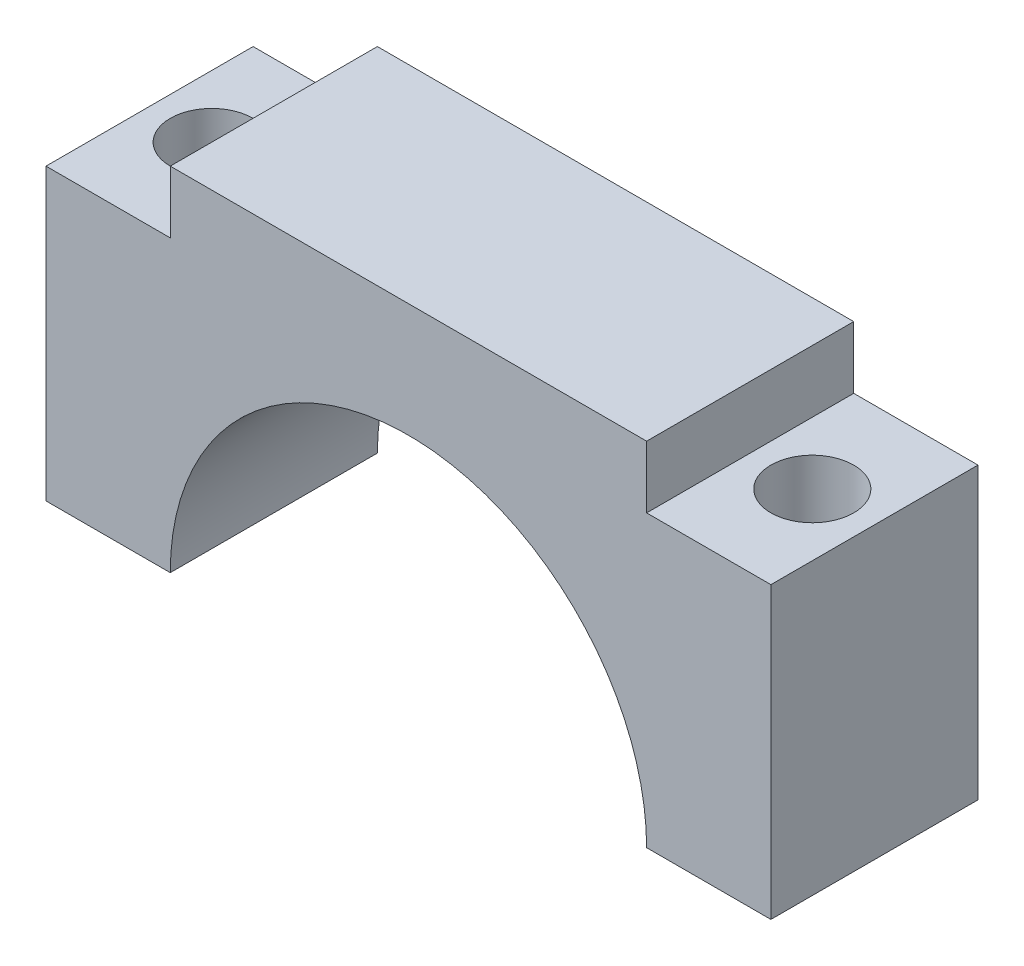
ISO-10303-21;
HEADER;
FILE_DESCRIPTION(('STEP AP214'),'2;1');
FILE_NAME('part.step','',(''),(''),'','','');
FILE_SCHEMA(('AUTOMOTIVE_DESIGN { 1 0 10303 214 1 1 1 1 }'));
ENDSEC;
DATA;
#1=APPLICATION_CONTEXT('core data for automotive mechanical design processes');
#2=APPLICATION_PROTOCOL_DEFINITION('international standard','automotive_design',2000,#1);
#3=PRODUCT_CONTEXT('',#1,'mechanical');
#4=PRODUCT('Part','Part','',(#3));
#5=PRODUCT_RELATED_PRODUCT_CATEGORY('part','',(#4));
#6=PRODUCT_DEFINITION_FORMATION('','',#4);
#7=PRODUCT_DEFINITION_CONTEXT('part definition',#1,'design');
#8=PRODUCT_DEFINITION('design','',#6,#7);
#9=PRODUCT_DEFINITION_SHAPE('','',#8);
#10=(LENGTH_UNIT() NAMED_UNIT(*) SI_UNIT(.MILLI.,.METRE.));
#11=(NAMED_UNIT(*) PLANE_ANGLE_UNIT() SI_UNIT($,.RADIAN.));
#12=(NAMED_UNIT(*) SI_UNIT($,.STERADIAN.) SOLID_ANGLE_UNIT());
#13=UNCERTAINTY_MEASURE_WITH_UNIT(LENGTH_MEASURE(1.E-05),#10,'distance_accuracy_value','');
#14=(GEOMETRIC_REPRESENTATION_CONTEXT(3) GLOBAL_UNCERTAINTY_ASSIGNED_CONTEXT((#13)) GLOBAL_UNIT_ASSIGNED_CONTEXT((#10,
#11,#12)) REPRESENTATION_CONTEXT('',''));
#15=CARTESIAN_POINT('',(0.,0.,0.));
#16=DIRECTION('',(0.,0.,1.));
#17=DIRECTION('',(1.,0.,0.));
#18=AXIS2_PLACEMENT_3D('',#15,#16,#17);
#19=CARTESIAN_POINT('',(-40.2820945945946,13.7884615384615,10.));
#20=DIRECTION('',(1.,0.,0.));
#21=DIRECTION('',(0.,0.,-1.));
#22=AXIS2_PLACEMENT_3D('',#19,#20,#21);
#23=PLANE('',#22);
#24=DIRECTION('',(0.,0.,1.));
#25=VECTOR('',#24,1.);
#26=CARTESIAN_POINT('',(-40.2820945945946,10.7884615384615,0.));
#27=LINE('',#26,#25);
#28=CARTESIAN_POINT('',(-40.2820945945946,10.7884615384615,0.));
#29=VERTEX_POINT('',#28);
#30=CARTESIAN_POINT('',(-40.2820945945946,10.7884615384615,10.));
#31=VERTEX_POINT('',#30);
#32=EDGE_CURVE('E147',#29,#31,#27,.T.);
#33=ORIENTED_EDGE('',*,*,#32,.F.);
#34=DIRECTION('',(0.,-1.,0.));
#35=VECTOR('',#34,1.);
#36=CARTESIAN_POINT('',(-40.2820945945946,13.7884615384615,0.));
#37=LINE('',#36,#35);
#38=CARTESIAN_POINT('',(-40.2820945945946,-3.21153846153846,0.));
#39=VERTEX_POINT('',#38);
#40=EDGE_CURVE('E168',#29,#39,#37,.T.);
#41=ORIENTED_EDGE('',*,*,#40,.T.);
#42=DIRECTION('',(0.,0.,-1.));
#43=VECTOR('',#42,1.);
#44=CARTESIAN_POINT('',(-40.2820945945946,-3.21153846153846,10.));
#45=LINE('',#44,#43);
#46=CARTESIAN_POINT('',(-40.2820945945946,-3.21153846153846,10.));
#47=VERTEX_POINT('',#46);
#48=EDGE_CURVE('E11',#47,#39,#45,.T.);
#49=ORIENTED_EDGE('',*,*,#48,.F.);
#50=DIRECTION('',(0.,-1.,0.));
#51=VECTOR('',#50,1.);
#52=CARTESIAN_POINT('',(-40.2820945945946,13.7884615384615,10.));
#53=LINE('',#52,#51);
#54=EDGE_CURVE('E171',#31,#47,#53,.T.);
#55=ORIENTED_EDGE('',*,*,#54,.F.);
#56=EDGE_LOOP('',(#33,#41,#49,#55));
#57=FACE_BOUND('',#56,.T.);
#58=ADVANCED_FACE('F33',(#57),#23,.F.);
#59=CARTESIAN_POINT('',(-37.2820945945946,13.7884615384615,5.));
#60=DIRECTION('',(0.,-1.,0.));
#61=DIRECTION('',(0.,0.,-1.));
#62=AXIS2_PLACEMENT_3D('',#59,#60,#61);
#63=CYLINDRICAL_SURFACE('',#62,2.);
#64=CARTESIAN_POINT('',(-37.2820945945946,-3.21153846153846,5.));
#65=DIRECTION('',(0.,-1.,0.));
#66=DIRECTION('',(0.,0.,-1.));
#67=AXIS2_PLACEMENT_3D('',#64,#65,#66);
#68=CIRCLE('',#67,2.);
#69=CARTESIAN_POINT('',(-37.2820945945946,-3.21153846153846,3.));
#70=VERTEX_POINT('',#69);
#71=EDGE_CURVE('E158',#70,#70,#68,.T.);
#72=ORIENTED_EDGE('',*,*,#71,.T.);
#73=EDGE_LOOP('',(#72));
#74=FACE_BOUND('',#73,.T.);
#75=CARTESIAN_POINT('',(-37.2820945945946,10.7884615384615,5.));
#76=DIRECTION('',(0.,1.,0.));
#77=DIRECTION('',(0.,0.,1.));
#78=AXIS2_PLACEMENT_3D('',#75,#76,#77);
#79=CIRCLE('',#78,2.);
#80=CARTESIAN_POINT('',(-37.2820945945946,10.7884615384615,7.));
#81=VERTEX_POINT('',#80);
#82=EDGE_CURVE('E36',#81,#81,#79,.F.);
#83=ORIENTED_EDGE('',*,*,#82,.F.);
#84=EDGE_LOOP('',(#83));
#85=FACE_BOUND('',#84,.T.);
#86=ADVANCED_FACE('F200',(#74,#85),#63,.F.);
#87=CARTESIAN_POINT('',(-40.2820945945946,-3.21153846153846,10.));
#88=DIRECTION('',(0.,1.,0.));
#89=DIRECTION('',(0.,0.,1.));
#90=AXIS2_PLACEMENT_3D('',#87,#88,#89);
#91=PLANE('',#90);
#92=ORIENTED_EDGE('',*,*,#71,.F.);
#93=EDGE_LOOP('',(#92));
#94=FACE_BOUND('',#93,.T.);
#95=DIRECTION('',(1.,0.,0.));
#96=VECTOR('',#95,1.);
#97=CARTESIAN_POINT('',(-40.2820945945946,-3.21153846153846,0.));
#98=LINE('',#97,#96);
#99=CARTESIAN_POINT('',(-34.2820945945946,-3.21153846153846,0.));
#100=VERTEX_POINT('',#99);
#101=EDGE_CURVE('E183',#39,#100,#98,.T.);
#102=ORIENTED_EDGE('',*,*,#101,.T.);
#103=DIRECTION('',(0.,0.,1.));
#104=VECTOR('',#103,1.);
#105=CARTESIAN_POINT('',(-34.2820945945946,-3.21153846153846,0.));
#106=LINE('',#105,#104);
#107=CARTESIAN_POINT('',(-34.2820945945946,-3.21153846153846,10.));
#108=VERTEX_POINT('',#107);
#109=EDGE_CURVE('E164',#100,#108,#106,.T.);
#110=ORIENTED_EDGE('',*,*,#109,.T.);
#111=DIRECTION('',(1.,0.,0.));
#112=VECTOR('',#111,1.);
#113=CARTESIAN_POINT('',(-40.2820945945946,-3.21153846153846,10.));
#114=LINE('',#113,#112);
#115=EDGE_CURVE('E175',#47,#108,#114,.T.);
#116=ORIENTED_EDGE('',*,*,#115,.F.);
#117=ORIENTED_EDGE('',*,*,#48,.T.);
#118=EDGE_LOOP('',(#102,#110,#116,#117));
#119=FACE_BOUND('',#118,.T.);
#120=ADVANCED_FACE('F202',(#94,#119),#91,.F.);
#121=CARTESIAN_POINT('',(-8.28209459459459,-3.21153846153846,5.));
#122=DIRECTION('',(0.,-1.,0.));
#123=DIRECTION('',(0.,0.,-1.));
#124=AXIS2_PLACEMENT_3D('',#121,#122,#123);
#125=CIRCLE('',#124,2.);
#126=CARTESIAN_POINT('',(-8.28209459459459,-3.21153846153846,3.));
#127=VERTEX_POINT('',#126);
#128=EDGE_CURVE('E154',#127,#127,#125,.T.);
#129=ORIENTED_EDGE('',*,*,#128,.F.);
#130=EDGE_LOOP('',(#129));
#131=FACE_BOUND('',#130,.T.);
#132=CARTESIAN_POINT('',(-11.2820945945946,-3.21153846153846,10.));
#133=VERTEX_POINT('',#132);
#134=CARTESIAN_POINT('',(-5.28209459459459,-3.21153846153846,10.));
#135=VERTEX_POINT('',#134);
#136=EDGE_CURVE('E173',#133,#135,#114,.T.);
#137=ORIENTED_EDGE('',*,*,#136,.F.);
#138=DIRECTION('',(0.,0.,1.));
#139=VECTOR('',#138,1.);
#140=CARTESIAN_POINT('',(-11.2820945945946,-3.21153846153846,0.));
#141=LINE('',#140,#139);
#142=CARTESIAN_POINT('',(-11.2820945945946,-3.21153846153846,0.));
#143=VERTEX_POINT('',#142);
#144=EDGE_CURVE('E166',#143,#133,#141,.T.);
#145=ORIENTED_EDGE('',*,*,#144,.F.);
#146=CARTESIAN_POINT('',(-5.28209459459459,-3.21153846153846,0.));
#147=VERTEX_POINT('',#146);
#148=EDGE_CURVE('E182',#143,#147,#98,.T.);
#149=ORIENTED_EDGE('',*,*,#148,.T.);
#150=DIRECTION('',(0.,0.,-1.));
#151=VECTOR('',#150,1.);
#152=CARTESIAN_POINT('',(-5.28209459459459,-3.21153846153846,10.));
#153=LINE('',#152,#151);
#154=EDGE_CURVE('E41',#135,#147,#153,.T.);
#155=ORIENTED_EDGE('',*,*,#154,.F.);
#156=EDGE_LOOP('',(#137,#145,#149,#155));
#157=FACE_BOUND('',#156,.T.);
#158=ADVANCED_FACE('F209',(#131,#157),#91,.F.);
#159=CARTESIAN_POINT('',(-5.28209459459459,13.7884615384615,10.));
#160=DIRECTION('',(-1.,0.,0.));
#161=DIRECTION('',(0.,-1.,0.));
#162=AXIS2_PLACEMENT_3D('',#159,#160,#161);
#163=PLANE('',#162);
#164=DIRECTION('',(0.,1.,0.));
#165=VECTOR('',#164,1.);
#166=CARTESIAN_POINT('',(-5.28209459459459,13.7884615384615,0.));
#167=LINE('',#166,#165);
#168=CARTESIAN_POINT('',(-5.28209459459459,10.7884615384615,0.));
#169=VERTEX_POINT('',#168);
#170=EDGE_CURVE('E186',#147,#169,#167,.T.);
#171=ORIENTED_EDGE('',*,*,#170,.T.);
#172=DIRECTION('',(0.,0.,-1.));
#173=VECTOR('',#172,1.);
#174=CARTESIAN_POINT('',(-5.28209459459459,10.7884615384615,0.));
#175=LINE('',#174,#173);
#176=CARTESIAN_POINT('',(-5.28209459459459,10.7884615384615,10.));
#177=VERTEX_POINT('',#176);
#178=EDGE_CURVE('E57',#177,#169,#175,.T.);
#179=ORIENTED_EDGE('',*,*,#178,.F.);
#180=DIRECTION('',(0.,1.,0.));
#181=VECTOR('',#180,1.);
#182=CARTESIAN_POINT('',(-5.28209459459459,13.7884615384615,10.));
#183=LINE('',#182,#181);
#184=EDGE_CURVE('E132',#135,#177,#183,.T.);
#185=ORIENTED_EDGE('',*,*,#184,.F.);
#186=ORIENTED_EDGE('',*,*,#154,.T.);
#187=EDGE_LOOP('',(#171,#179,#185,#186));
#188=FACE_BOUND('',#187,.T.);
#189=ADVANCED_FACE('F229',(#188),#163,.F.);
#190=CARTESIAN_POINT('',(-40.2820945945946,13.7884615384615,10.));
#191=DIRECTION('',(0.,-1.,0.));
#192=DIRECTION('',(0.,0.,-1.));
#193=AXIS2_PLACEMENT_3D('',#190,#191,#192);
#194=PLANE('',#193);
#195=DIRECTION('',(-1.,0.,0.));
#196=VECTOR('',#195,1.);
#197=CARTESIAN_POINT('',(-40.2820945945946,13.7884615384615,10.));
#198=LINE('',#197,#196);
#199=CARTESIAN_POINT('',(-11.2820945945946,13.7884615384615,10.));
#200=VERTEX_POINT('',#199);
#201=CARTESIAN_POINT('',(-34.2820945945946,13.7884615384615,10.));
#202=VERTEX_POINT('',#201);
#203=EDGE_CURVE('E179',#200,#202,#198,.T.);
#204=ORIENTED_EDGE('',*,*,#203,.F.);
#205=DIRECTION('',(0.,0.,1.));
#206=VECTOR('',#205,1.);
#207=CARTESIAN_POINT('',(-11.2820945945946,13.7884615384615,10.));
#208=LINE('',#207,#206);
#209=CARTESIAN_POINT('',(-11.2820945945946,13.7884615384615,0.));
#210=VERTEX_POINT('',#209);
#211=EDGE_CURVE('E116',#210,#200,#208,.T.);
#212=ORIENTED_EDGE('',*,*,#211,.F.);
#213=DIRECTION('',(-1.,0.,0.));
#214=VECTOR('',#213,1.);
#215=CARTESIAN_POINT('',(-40.2820945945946,13.7884615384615,0.));
#216=LINE('',#215,#214);
#217=CARTESIAN_POINT('',(-34.2820945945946,13.7884615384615,0.));
#218=VERTEX_POINT('',#217);
#219=EDGE_CURVE('E174',#210,#218,#216,.T.);
#220=ORIENTED_EDGE('',*,*,#219,.T.);
#221=DIRECTION('',(0.,0.,-1.));
#222=VECTOR('',#221,1.);
#223=CARTESIAN_POINT('',(-34.2820945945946,13.7884615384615,10.));
#224=LINE('',#223,#222);
#225=EDGE_CURVE('E143',#202,#218,#224,.T.);
#226=ORIENTED_EDGE('',*,*,#225,.F.);
#227=EDGE_LOOP('',(#204,#212,#220,#226));
#228=FACE_BOUND('',#227,.T.);
#229=ADVANCED_FACE('F223',(#228),#194,.F.);
#230=CARTESIAN_POINT('',(0.,0.,10.));
#231=DIRECTION('',(0.,0.,1.));
#232=DIRECTION('',(1.,0.,0.));
#233=AXIS2_PLACEMENT_3D('',#230,#231,#232);
#234=PLANE('',#233);
#235=DIRECTION('',(0.,1.,0.));
#236=VECTOR('',#235,1.);
#237=CARTESIAN_POINT('',(-11.2820945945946,10.7884615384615,10.));
#238=LINE('',#237,#236);
#239=CARTESIAN_POINT('',(-11.2820945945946,10.7884615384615,10.));
#240=VERTEX_POINT('',#239);
#241=EDGE_CURVE('E111',#240,#200,#238,.T.);
#242=ORIENTED_EDGE('',*,*,#241,.T.);
#243=ORIENTED_EDGE('',*,*,#203,.T.);
#244=DIRECTION('',(0.,1.,0.));
#245=VECTOR('',#244,1.);
#246=CARTESIAN_POINT('',(-34.2820945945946,10.7884615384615,10.));
#247=LINE('',#246,#245);
#248=CARTESIAN_POINT('',(-34.2820945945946,10.7884615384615,10.));
#249=VERTEX_POINT('',#248);
#250=EDGE_CURVE('E149',#249,#202,#247,.T.);
#251=ORIENTED_EDGE('',*,*,#250,.F.);
#252=DIRECTION('',(1.,0.,0.));
#253=VECTOR('',#252,1.);
#254=CARTESIAN_POINT('',(-40.2820945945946,10.7884615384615,10.));
#255=LINE('',#254,#253);
#256=EDGE_CURVE('E141',#31,#249,#255,.T.);
#257=ORIENTED_EDGE('',*,*,#256,.F.);
#258=ORIENTED_EDGE('',*,*,#54,.T.);
#259=ORIENTED_EDGE('',*,*,#115,.T.);
#260=CARTESIAN_POINT('',(-22.7820945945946,-3.21153846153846,10.));
#261=DIRECTION('',(0.,0.,1.));
#262=DIRECTION('',(1.,0.,0.));
#263=AXIS2_PLACEMENT_3D('',#260,#261,#262);
#264=CIRCLE('',#263,11.5);
#265=EDGE_CURVE('E157',#133,#108,#264,.T.);
#266=ORIENTED_EDGE('',*,*,#265,.F.);
#267=ORIENTED_EDGE('',*,*,#136,.T.);
#268=ORIENTED_EDGE('',*,*,#184,.T.);
#269=DIRECTION('',(1.,0.,0.));
#270=VECTOR('',#269,1.);
#271=CARTESIAN_POINT('',(-5.28209459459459,10.7884615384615,10.));
#272=LINE('',#271,#270);
#273=EDGE_CURVE('E126',#240,#177,#272,.T.);
#274=ORIENTED_EDGE('',*,*,#273,.F.);
#275=EDGE_LOOP('',(#242,#243,#251,#257,#258,#259,#266,#267,#268,#274));
#276=FACE_BOUND('',#275,.T.);
#277=ADVANCED_FACE('F130',(#276),#234,.T.);
#278=CARTESIAN_POINT('',(0.,0.,0.));
#279=DIRECTION('',(0.,0.,1.));
#280=DIRECTION('',(1.,0.,0.));
#281=AXIS2_PLACEMENT_3D('',#278,#279,#280);
#282=PLANE('',#281);
#283=ORIENTED_EDGE('',*,*,#219,.F.);
#284=DIRECTION('',(0.,1.,0.));
#285=VECTOR('',#284,1.);
#286=CARTESIAN_POINT('',(-11.2820945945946,10.7884615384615,0.));
#287=LINE('',#286,#285);
#288=CARTESIAN_POINT('',(-11.2820945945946,10.7884615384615,0.));
#289=VERTEX_POINT('',#288);
#290=EDGE_CURVE('E121',#289,#210,#287,.T.);
#291=ORIENTED_EDGE('',*,*,#290,.F.);
#292=DIRECTION('',(-1.,0.,0.));
#293=VECTOR('',#292,1.);
#294=CARTESIAN_POINT('',(-11.2820945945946,10.7884615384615,0.));
#295=LINE('',#294,#293);
#296=EDGE_CURVE('E122',#169,#289,#295,.T.);
#297=ORIENTED_EDGE('',*,*,#296,.F.);
#298=ORIENTED_EDGE('',*,*,#170,.F.);
#299=ORIENTED_EDGE('',*,*,#148,.F.);
#300=CARTESIAN_POINT('',(-22.7820945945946,-3.21153846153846,0.));
#301=DIRECTION('',(0.,0.,1.));
#302=DIRECTION('',(1.,0.,0.));
#303=AXIS2_PLACEMENT_3D('',#300,#301,#302);
#304=CIRCLE('',#303,11.5);
#305=EDGE_CURVE('E161',#143,#100,#304,.T.);
#306=ORIENTED_EDGE('',*,*,#305,.T.);
#307=ORIENTED_EDGE('',*,*,#101,.F.);
#308=ORIENTED_EDGE('',*,*,#40,.F.);
#309=DIRECTION('',(-1.,0.,0.));
#310=VECTOR('',#309,1.);
#311=CARTESIAN_POINT('',(-34.2820945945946,10.7884615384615,0.));
#312=LINE('',#311,#310);
#313=CARTESIAN_POINT('',(-34.2820945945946,10.7884615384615,0.));
#314=VERTEX_POINT('',#313);
#315=EDGE_CURVE('E145',#314,#29,#312,.T.);
#316=ORIENTED_EDGE('',*,*,#315,.F.);
#317=DIRECTION('',(0.,1.,0.));
#318=VECTOR('',#317,1.);
#319=CARTESIAN_POINT('',(-34.2820945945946,10.7884615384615,0.));
#320=LINE('',#319,#318);
#321=EDGE_CURVE('E138',#314,#218,#320,.T.);
#322=ORIENTED_EDGE('',*,*,#321,.T.);
#323=EDGE_LOOP('',(#283,#291,#297,#298,#299,#306,#307,#308,#316,#322));
#324=FACE_BOUND('',#323,.T.);
#325=ADVANCED_FACE('F219',(#324),#282,.F.);
#326=CARTESIAN_POINT('',(-22.7820945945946,-3.21153846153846,0.));
#327=DIRECTION('',(0.,0.,1.));
#328=DIRECTION('',(1.,0.,0.));
#329=AXIS2_PLACEMENT_3D('',#326,#327,#328);
#330=CYLINDRICAL_SURFACE('',#329,11.5);
#331=ORIENTED_EDGE('',*,*,#265,.T.);
#332=ORIENTED_EDGE('',*,*,#109,.F.);
#333=ORIENTED_EDGE('',*,*,#305,.F.);
#334=ORIENTED_EDGE('',*,*,#144,.T.);
#335=EDGE_LOOP('',(#331,#332,#333,#334));
#336=FACE_BOUND('',#335,.T.);
#337=ADVANCED_FACE('F216',(#336),#330,.F.);
#338=CARTESIAN_POINT('',(-8.28209459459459,13.7884615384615,5.));
#339=DIRECTION('',(0.,-1.,0.));
#340=DIRECTION('',(0.,0.,-1.));
#341=AXIS2_PLACEMENT_3D('',#338,#339,#340);
#342=CYLINDRICAL_SURFACE('',#341,2.);
#343=CARTESIAN_POINT('',(-8.28209459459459,10.7884615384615,5.));
#344=DIRECTION('',(0.,-1.,0.));
#345=DIRECTION('',(0.,0.,-1.));
#346=AXIS2_PLACEMENT_3D('',#343,#344,#345);
#347=CIRCLE('',#346,2.);
#348=CARTESIAN_POINT('',(-8.28209459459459,10.7884615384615,3.));
#349=VERTEX_POINT('',#348);
#350=EDGE_CURVE('E139',#349,#349,#347,.F.);
#351=ORIENTED_EDGE('',*,*,#350,.T.);
#352=EDGE_LOOP('',(#351));
#353=FACE_BOUND('',#352,.T.);
#354=ORIENTED_EDGE('',*,*,#128,.T.);
#355=EDGE_LOOP('',(#354));
#356=FACE_BOUND('',#355,.T.);
#357=ADVANCED_FACE('F214',(#353,#356),#342,.F.);
#358=CARTESIAN_POINT('',(0.,10.7884615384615,0.));
#359=DIRECTION('',(0.,-1.,0.));
#360=DIRECTION('',(0.,0.,-1.));
#361=AXIS2_PLACEMENT_3D('',#358,#359,#360);
#362=PLANE('',#361);
#363=DIRECTION('',(0.,0.,1.));
#364=VECTOR('',#363,1.);
#365=CARTESIAN_POINT('',(-11.2820945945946,10.7884615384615,10.));
#366=LINE('',#365,#364);
#367=EDGE_CURVE('E114',#289,#240,#366,.T.);
#368=ORIENTED_EDGE('',*,*,#367,.T.);
#369=ORIENTED_EDGE('',*,*,#273,.T.);
#370=ORIENTED_EDGE('',*,*,#178,.T.);
#371=ORIENTED_EDGE('',*,*,#296,.T.);
#372=EDGE_LOOP('',(#368,#369,#370,#371));
#373=FACE_BOUND('',#372,.T.);
#374=ORIENTED_EDGE('',*,*,#350,.F.);
#375=EDGE_LOOP('',(#374));
#376=FACE_BOUND('',#375,.T.);
#377=ADVANCED_FACE('F124',(#373,#376),#362,.F.);
#378=CARTESIAN_POINT('',(-11.2820945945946,10.7884615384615,10.));
#379=DIRECTION('',(-1.,0.,0.));
#380=DIRECTION('',(0.,0.,1.));
#381=AXIS2_PLACEMENT_3D('',#378,#379,#380);
#382=PLANE('',#381);
#383=ORIENTED_EDGE('',*,*,#211,.T.);
#384=ORIENTED_EDGE('',*,*,#241,.F.);
#385=ORIENTED_EDGE('',*,*,#367,.F.);
#386=ORIENTED_EDGE('',*,*,#290,.T.);
#387=EDGE_LOOP('',(#383,#384,#385,#386));
#388=FACE_BOUND('',#387,.T.);
#389=ADVANCED_FACE('F113',(#388),#382,.F.);
#390=CARTESIAN_POINT('',(0.,10.7884615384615,0.));
#391=DIRECTION('',(0.,1.,0.));
#392=DIRECTION('',(0.,0.,1.));
#393=AXIS2_PLACEMENT_3D('',#390,#391,#392);
#394=PLANE('',#393);
#395=ORIENTED_EDGE('',*,*,#256,.T.);
#396=DIRECTION('',(0.,0.,-1.));
#397=VECTOR('',#396,1.);
#398=CARTESIAN_POINT('',(-34.2820945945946,10.7884615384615,10.));
#399=LINE('',#398,#397);
#400=EDGE_CURVE('E49',#249,#314,#399,.T.);
#401=ORIENTED_EDGE('',*,*,#400,.T.);
#402=ORIENTED_EDGE('',*,*,#315,.T.);
#403=ORIENTED_EDGE('',*,*,#32,.T.);
#404=EDGE_LOOP('',(#395,#401,#402,#403));
#405=FACE_BOUND('',#404,.T.);
#406=ORIENTED_EDGE('',*,*,#82,.T.);
#407=EDGE_LOOP('',(#406));
#408=FACE_BOUND('',#407,.T.);
#409=ADVANCED_FACE('F198',(#405,#408),#394,.T.);
#410=CARTESIAN_POINT('',(-34.2820945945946,10.7884615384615,10.));
#411=DIRECTION('',(1.,0.,0.));
#412=DIRECTION('',(0.,0.,-1.));
#413=AXIS2_PLACEMENT_3D('',#410,#411,#412);
#414=PLANE('',#413);
#415=ORIENTED_EDGE('',*,*,#225,.T.);
#416=ORIENTED_EDGE('',*,*,#321,.F.);
#417=ORIENTED_EDGE('',*,*,#400,.F.);
#418=ORIENTED_EDGE('',*,*,#250,.T.);
#419=EDGE_LOOP('',(#415,#416,#417,#418));
#420=FACE_BOUND('',#419,.T.);
#421=ADVANCED_FACE('F257',(#420),#414,.F.);
#422=CLOSED_SHELL('',(#58,#86,#120,#158,#189,#229,#277,#325,#337,#357,#377,#389,#409,#421));
#423=MANIFOLD_SOLID_BREP('B2',#422);
#424=ADVANCED_BREP_SHAPE_REPRESENTATION('',(#18,#423),#14);
#425=SHAPE_DEFINITION_REPRESENTATION(#9,#424);
ENDSEC;
END-ISO-10303-21;
